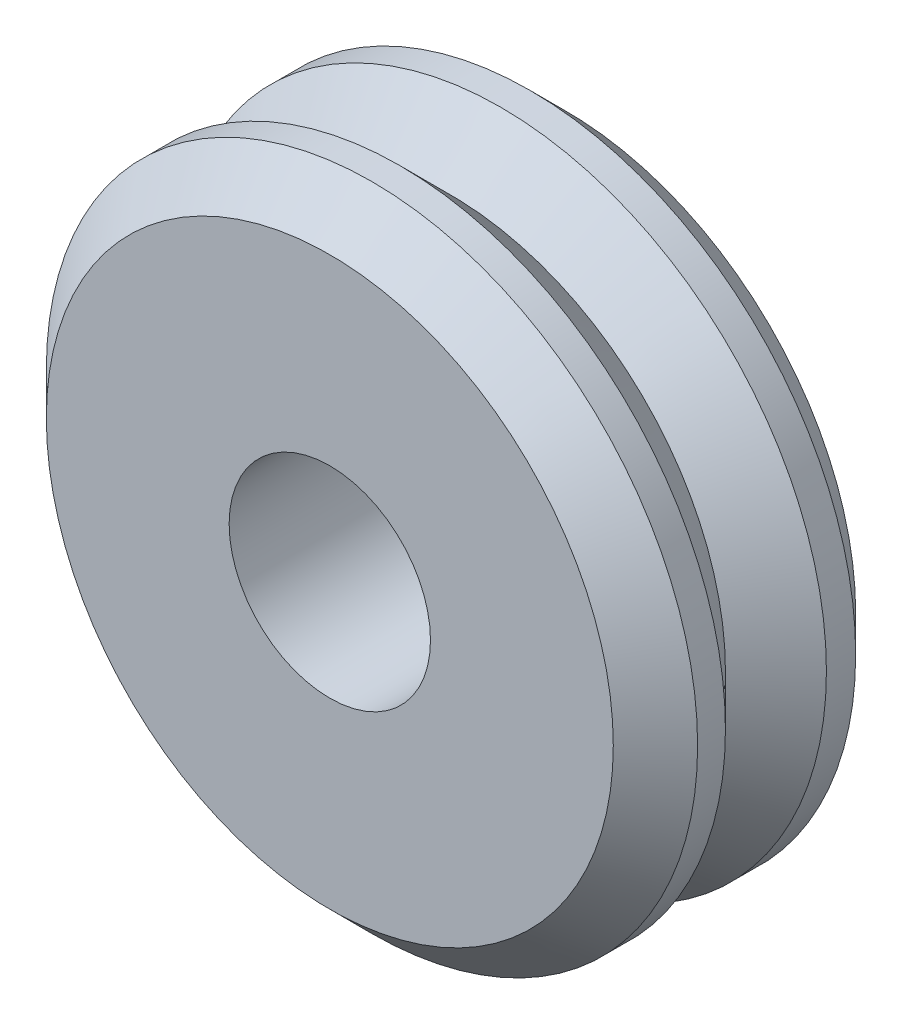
from build123d import *

# Parameters (mm, degrees)
ESQUISSE1_R        = 15.365
ESQUISSE1_R_2      = 4.75
BOSS_EXTRU_1_DEPTH = 11.13


with BuildPart() as part:
    # Esquisse1 → Boss.-Extru.1 (new body)
    with BuildSketch(Plane.XY):
        with Locations(Location((0, 0, 0), (0, 0, 180))):
            Circle(ESQUISSE1_R)
        with Locations(Location((0, 0, 0), (0, 0, 180))):
            Circle(ESQUISSE1_R_2, mode=Mode.SUBTRACT)
    extrude(amount=BOSS_EXTRU_1_DEPTH)

    # Esquisse2 → Enl_vement de mati_re-R_volution1 (revolve, cut)
    with BuildSketch(Plane(origin=(0, 0, 0), x_dir=(0, 0, -1), z_dir=(1, 0, 0)), mode=Mode.PRIVATE) as enl_vement_de_mati_re_r_volution1_sk:
        Polygon((-11.522812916, 12.982684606), (-8.484384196, 16.021113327), (-5.445955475, 12.982684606), (-2.373538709, 16.055101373), (0.698878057, 12.982684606), (0.698878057, 17.932450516), (-11.522812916, 17.932450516), align=None)
    revolve(enl_vement_de_mati_re_r_volution1_sk.sketch.rotate(Axis((0, 0, 11.13), (0, 0, -1)), 270), axis=Axis((0, 0, 11.13), (0, 0, -1)), mode=Mode.SUBTRACT)


solid = part.part
